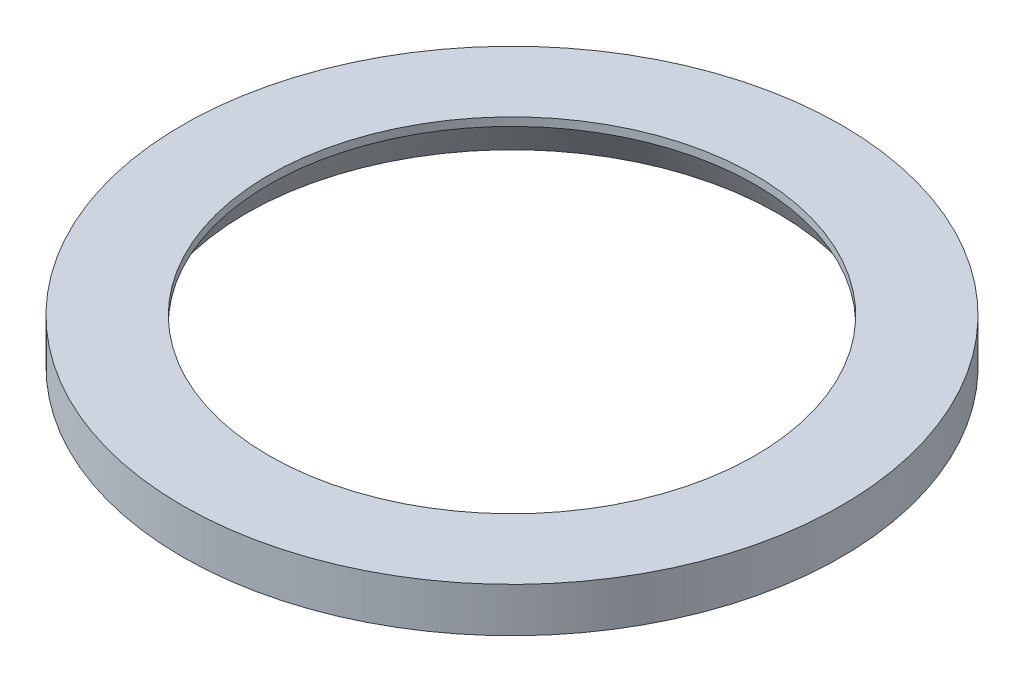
ISO-10303-21;
HEADER;
FILE_DESCRIPTION(('STEP AP214'),'2;1');
FILE_NAME('part.step','',(''),(''),'','','');
FILE_SCHEMA(('AUTOMOTIVE_DESIGN { 1 0 10303 214 1 1 1 1 }'));
ENDSEC;
DATA;
#1=APPLICATION_CONTEXT('core data for automotive mechanical design processes');
#2=APPLICATION_PROTOCOL_DEFINITION('international standard','automotive_design',2000,#1);
#3=PRODUCT_CONTEXT('',#1,'mechanical');
#4=PRODUCT('Part','Part','',(#3));
#5=PRODUCT_RELATED_PRODUCT_CATEGORY('part','',(#4));
#6=PRODUCT_DEFINITION_FORMATION('','',#4);
#7=PRODUCT_DEFINITION_CONTEXT('part definition',#1,'design');
#8=PRODUCT_DEFINITION('design','',#6,#7);
#9=PRODUCT_DEFINITION_SHAPE('','',#8);
#10=(LENGTH_UNIT() NAMED_UNIT(*) SI_UNIT(.MILLI.,.METRE.));
#11=(NAMED_UNIT(*) PLANE_ANGLE_UNIT() SI_UNIT($,.RADIAN.));
#12=(NAMED_UNIT(*) SI_UNIT($,.STERADIAN.) SOLID_ANGLE_UNIT());
#13=UNCERTAINTY_MEASURE_WITH_UNIT(LENGTH_MEASURE(1.E-05),#10,'distance_accuracy_value','');
#14=(GEOMETRIC_REPRESENTATION_CONTEXT(3) GLOBAL_UNCERTAINTY_ASSIGNED_CONTEXT((#13)) GLOBAL_UNIT_ASSIGNED_CONTEXT((#10,
#11,#12)) REPRESENTATION_CONTEXT('',''));
#15=CARTESIAN_POINT('',(0.,0.,0.));
#16=DIRECTION('',(0.,0.,1.));
#17=DIRECTION('',(1.,0.,0.));
#18=AXIS2_PLACEMENT_3D('',#15,#16,#17);
#19=CARTESIAN_POINT('',(-16.1247125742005,-2.7,0.));
#20=DIRECTION('',(0.,-1.,0.));
#21=DIRECTION('',(0.,0.,-1.));
#22=AXIS2_PLACEMENT_3D('',#19,#20,#21);
#23=PLANE('',#22);
#24=CARTESIAN_POINT('',(0.,-2.7,0.));
#25=DIRECTION('',(0.,1.,0.));
#26=DIRECTION('',(0.,0.,1.));
#27=AXIS2_PLACEMENT_3D('',#24,#25,#26);
#28=CIRCLE('',#27,20.);
#29=CARTESIAN_POINT('',(0.,-2.7,20.));
#30=VERTEX_POINT('',#29);
#31=EDGE_CURVE('E29',#30,#30,#28,.T.);
#32=ORIENTED_EDGE('',*,*,#31,.F.);
#33=EDGE_LOOP('',(#32));
#34=FACE_BOUND('',#33,.T.);
#35=CARTESIAN_POINT('',(0.,-2.7,0.));
#36=DIRECTION('',(0.,-1.,0.));
#37=DIRECTION('',(0.,0.,-1.));
#38=AXIS2_PLACEMENT_3D('',#35,#36,#37);
#39=CIRCLE('',#38,16.1247125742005);
#40=CARTESIAN_POINT('',(0.,-2.7,-16.1247125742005));
#41=VERTEX_POINT('',#40);
#42=EDGE_CURVE('E17',#41,#41,#39,.F.);
#43=ORIENTED_EDGE('',*,*,#42,.T.);
#44=EDGE_LOOP('',(#43));
#45=FACE_BOUND('',#44,.T.);
#46=ADVANCED_FACE('F14',(#34,#45),#23,.T.);
#47=CARTESIAN_POINT('',(0.,-2.7,0.));
#48=DIRECTION('',(0.,-1.,0.));
#49=DIRECTION('',(0.,0.,-1.));
#50=AXIS2_PLACEMENT_3D('',#47,#48,#49);
#51=CONICAL_SURFACE('',#50,16.1247125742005,0.558505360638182);
#52=ORIENTED_EDGE('',*,*,#42,.F.);
#53=EDGE_LOOP('',(#52));
#54=FACE_BOUND('',#53,.T.);
#55=CARTESIAN_POINT('',(0.,-0.5,0.));
#56=DIRECTION('',(0.,1.,0.));
#57=DIRECTION('',(0.,0.,1.));
#58=AXIS2_PLACEMENT_3D('',#55,#56,#57);
#59=CIRCLE('',#58,14.75);
#60=CARTESIAN_POINT('',(0.,-0.5,14.75));
#61=VERTEX_POINT('',#60);
#62=EDGE_CURVE('E26',#61,#61,#59,.T.);
#63=ORIENTED_EDGE('',*,*,#62,.T.);
#64=EDGE_LOOP('',(#63));
#65=FACE_BOUND('',#64,.T.);
#66=ADVANCED_FACE('F38',(#54,#65),#51,.F.);
#67=CARTESIAN_POINT('',(0.,3.742203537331,0.));
#68=DIRECTION('',(0.,1.,0.));
#69=DIRECTION('',(0.,0.,1.));
#70=AXIS2_PLACEMENT_3D('',#67,#68,#69);
#71=CYLINDRICAL_SURFACE('',#70,20.);
#72=ORIENTED_EDGE('',*,*,#31,.T.);
#73=EDGE_LOOP('',(#72));
#74=FACE_BOUND('',#73,.T.);
#75=CARTESIAN_POINT('',(0.,0.,0.));
#76=DIRECTION('',(0.,1.,0.));
#77=DIRECTION('',(0.,0.,1.));
#78=AXIS2_PLACEMENT_3D('',#75,#76,#77);
#79=CIRCLE('',#78,20.);
#80=CARTESIAN_POINT('',(0.,0.,20.));
#81=VERTEX_POINT('',#80);
#82=EDGE_CURVE('E21',#81,#81,#79,.T.);
#83=ORIENTED_EDGE('',*,*,#82,.F.);
#84=EDGE_LOOP('',(#83));
#85=FACE_BOUND('',#84,.T.);
#86=ADVANCED_FACE('F41',(#74,#85),#71,.T.);
#87=CARTESIAN_POINT('',(0.,3.742203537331,0.));
#88=DIRECTION('',(0.,1.,0.));
#89=DIRECTION('',(0.,0.,1.));
#90=AXIS2_PLACEMENT_3D('',#87,#88,#89);
#91=CYLINDRICAL_SURFACE('',#90,14.75);
#92=CARTESIAN_POINT('',(0.,0.,0.));
#93=DIRECTION('',(0.,1.,0.));
#94=DIRECTION('',(0.,0.,1.));
#95=AXIS2_PLACEMENT_3D('',#92,#93,#94);
#96=CIRCLE('',#95,14.75);
#97=CARTESIAN_POINT('',(0.,0.,14.75));
#98=VERTEX_POINT('',#97);
#99=EDGE_CURVE('E10',#98,#98,#96,.F.);
#100=ORIENTED_EDGE('',*,*,#99,.F.);
#101=EDGE_LOOP('',(#100));
#102=FACE_BOUND('',#101,.T.);
#103=ORIENTED_EDGE('',*,*,#62,.F.);
#104=EDGE_LOOP('',(#103));
#105=FACE_BOUND('',#104,.T.);
#106=ADVANCED_FACE('F44',(#102,#105),#91,.F.);
#107=CARTESIAN_POINT('',(-14.75,0.,0.));
#108=DIRECTION('',(0.,1.,0.));
#109=DIRECTION('',(0.,0.,1.));
#110=AXIS2_PLACEMENT_3D('',#107,#108,#109);
#111=PLANE('',#110);
#112=ORIENTED_EDGE('',*,*,#99,.T.);
#113=EDGE_LOOP('',(#112));
#114=FACE_BOUND('',#113,.T.);
#115=ORIENTED_EDGE('',*,*,#82,.T.);
#116=EDGE_LOOP('',(#115));
#117=FACE_BOUND('',#116,.T.);
#118=ADVANCED_FACE('F46',(#114,#117),#111,.T.);
#119=CLOSED_SHELL('',(#46,#66,#86,#106,#118));
#120=MANIFOLD_SOLID_BREP('B1',#119);
#121=ADVANCED_BREP_SHAPE_REPRESENTATION('',(#18,#120),#14);
#122=SHAPE_DEFINITION_REPRESENTATION(#9,#121);
ENDSEC;
END-ISO-10303-21;
